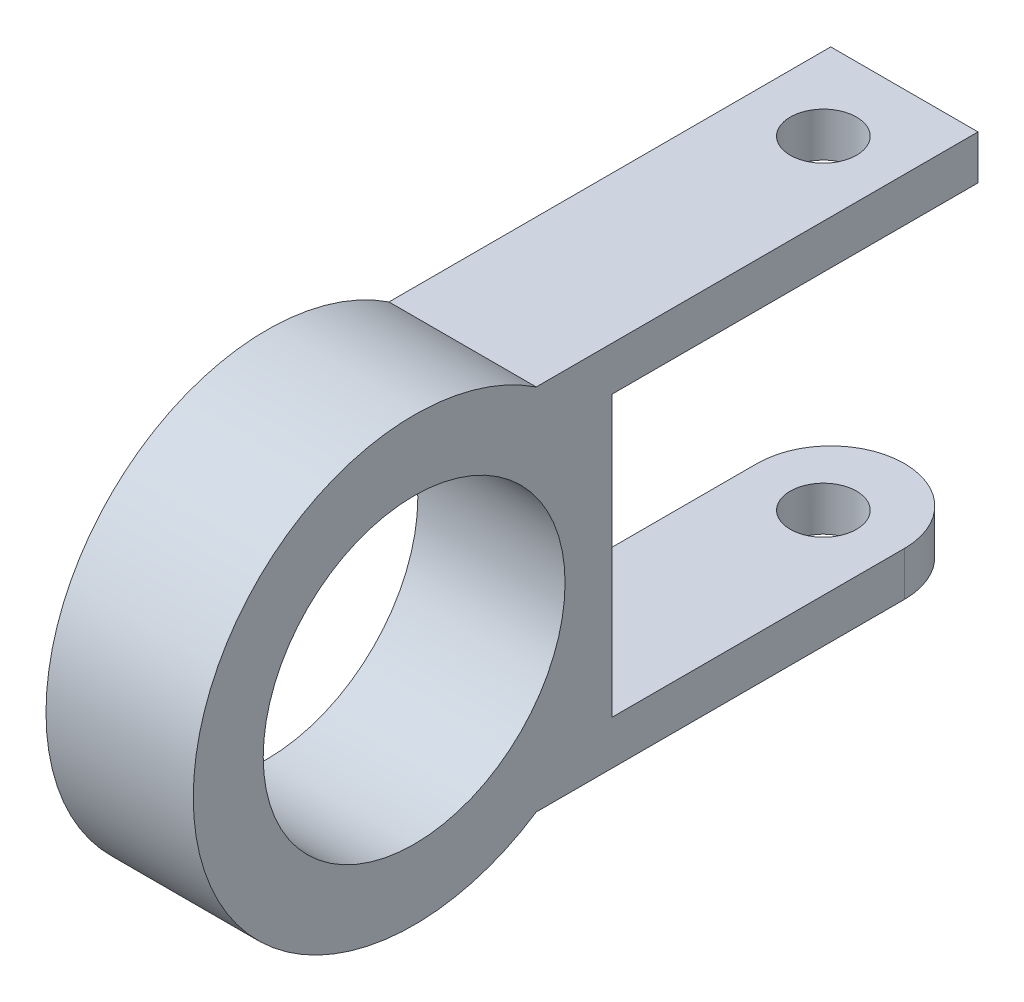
from build123d import *

# Parameters (mm, degrees)
BOSS_EXTRUDE1_DEPTH     = 10
SKETCH5_W               = 27.074863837
SKETCH5_H               = 19
CUT_EXTRUDE1_DEPTH      = 23
CUT_EXTRUDE2_DEPTH      = 18
CUT_EXTRUDE2_DEPTH_BACK = 49.192257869
SKETCH6_R               = 2.25
FILLET1_RADIUS          = 5
FILLET1_LENGTH          = 3
SKETCH7_R               = 10.25
CUT_EXTRUDE3_DEPTH      = 43.3230873


with BuildPart() as part:
    # Sketch3 → Boss-Extrude1 (new body)
    with BuildSketch(Plane(origin=(0, 0, 0), x_dir=(0, 0, -1), z_dir=(1, 0, 0))):
        with BuildLine():
            Line((38.291561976, 12.5), (8.291561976, 12.5))
            ThreePointArc((8.291561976, 12.5), (-15, 0), (8.291561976, -12.5))
            Line((8.291561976, -12.5), (38.291561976, -12.5))
            Line((38.291561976, -12.5), (38.291561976, 0))
            Line((38.291561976, 0), (38.291561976, 12.5))
        make_face()
        with BuildLine():
            Line((-10.25, 0), (10.25, 0))
            ThreePointArc((10.25, 0), (0, -10.25), (-10.25, 0))
        make_face(mode=Mode.SUBTRACT)
    extrude(amount=BOSS_EXTRUDE1_DEPTH)

    # Sketch5 → Cut-Extrude1 (cut)
    with BuildSketch(Plane(origin=(10, 0, 0), x_dir=(0, 0, -1), z_dir=(1, 0, 0))):
        with Locations((26.985238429, 0)):
            Rectangle(SKETCH5_W, SKETCH5_H)
    extrude(amount=-CUT_EXTRUDE1_DEPTH, mode=Mode.SUBTRACT)

    # Sketch6 → Cut-Extrude2 (cut, two sides: drawn at the far end of the back side and taken through both)
    with BuildSketch(Plane.XZ.offset(12.5).offset(-CUT_EXTRUDE2_DEPTH_BACK)):
        with Locations(Location((5, -32.791561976, 0), (0, 0, 90))):
            Circle(SKETCH6_R)
    extrude(amount=CUT_EXTRUDE2_DEPTH + CUT_EXTRUDE2_DEPTH_BACK, mode=Mode.SUBTRACT)

    # Fillet1: full round fillet: the end face becomes a half cylinder, R = half its width
    fillet1_face = Plane((5, -11, -38.291561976), x_dir=(0, -1, 0), z_dir=(0, 0, -1))  # on the end face: x along it, z out of the body
    fillet1_slab = fillet1_face.offset(-FILLET1_RADIUS / 2) * Box(FILLET1_LENGTH, 2 * FILLET1_RADIUS, FILLET1_RADIUS, mode=Mode.PRIVATE)  # the body's end, R deep
    fillet1_round = Plane((5, -11, -33.291561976), x_dir=(0, 0, -1), z_dir=(0, -1, 0)) * Cylinder(FILLET1_RADIUS, FILLET1_LENGTH, mode=Mode.PRIVATE)  # its axis R under the face
    add(fillet1_slab - fillet1_round, mode=Mode.SUBTRACT)

    # Sketch7 → Cut-Extrude3 (cut, through all)
    with BuildSketch(Plane(origin=(10, 0, 0), x_dir=(0, 0, -1), z_dir=(1, 0, 0))):
        Circle(SKETCH7_R)
    extrude(amount=-CUT_EXTRUDE3_DEPTH, mode=Mode.SUBTRACT)


solid = part.part
